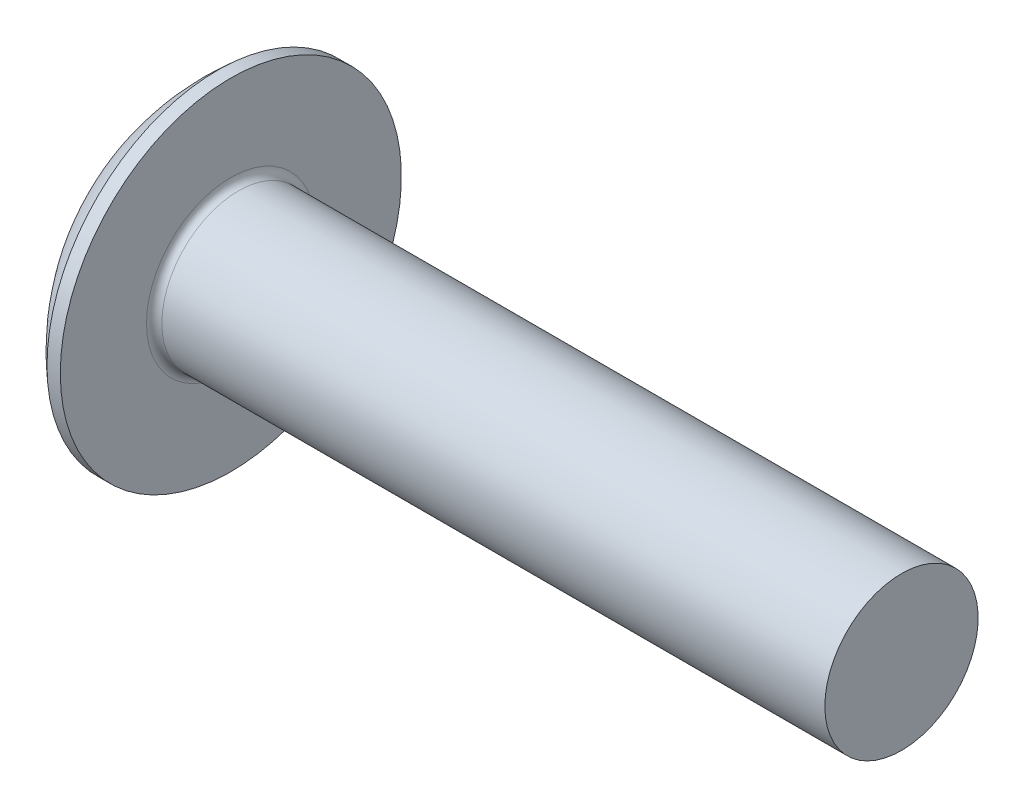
ISO-10303-21;
HEADER;
FILE_DESCRIPTION(('STEP AP214'),'2;1');
FILE_NAME('part.step','',(''),(''),'','','');
FILE_SCHEMA(('AUTOMOTIVE_DESIGN { 1 0 10303 214 1 1 1 1 }'));
ENDSEC;
DATA;
#1=APPLICATION_CONTEXT('core data for automotive mechanical design processes');
#2=APPLICATION_PROTOCOL_DEFINITION('international standard','automotive_design',2000,#1);
#3=PRODUCT_CONTEXT('',#1,'mechanical');
#4=PRODUCT('Part','Part','',(#3));
#5=PRODUCT_RELATED_PRODUCT_CATEGORY('part','',(#4));
#6=PRODUCT_DEFINITION_FORMATION('','',#4);
#7=PRODUCT_DEFINITION_CONTEXT('part definition',#1,'design');
#8=PRODUCT_DEFINITION('design','',#6,#7);
#9=PRODUCT_DEFINITION_SHAPE('','',#8);
#10=(LENGTH_UNIT() NAMED_UNIT(*) SI_UNIT(.MILLI.,.METRE.));
#11=(NAMED_UNIT(*) PLANE_ANGLE_UNIT() SI_UNIT($,.RADIAN.));
#12=(NAMED_UNIT(*) SI_UNIT($,.STERADIAN.) SOLID_ANGLE_UNIT());
#13=UNCERTAINTY_MEASURE_WITH_UNIT(LENGTH_MEASURE(1.E-05),#10,'distance_accuracy_value','');
#14=(GEOMETRIC_REPRESENTATION_CONTEXT(3) GLOBAL_UNCERTAINTY_ASSIGNED_CONTEXT((#13)) GLOBAL_UNIT_ASSIGNED_CONTEXT((#10,
#11,#12)) REPRESENTATION_CONTEXT('',''));
#15=CARTESIAN_POINT('',(0.,0.,0.));
#16=DIRECTION('',(0.,0.,1.));
#17=DIRECTION('',(1.,0.,0.));
#18=AXIS2_PLACEMENT_3D('',#15,#16,#17);
#19=CARTESIAN_POINT('',(11.7,0.,0.));
#20=DIRECTION('',(-1.,0.,0.));
#21=DIRECTION('',(0.,1.,0.));
#22=AXIS2_PLACEMENT_3D('',#19,#20,#21);
#23=SPHERICAL_SURFACE('',#22,11.7);
#24=CARTESIAN_POINT('',(4.10526498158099,0.,0.));
#25=DIRECTION('',(-1.,0.,0.));
#26=DIRECTION('',(0.,0.,1.));
#27=AXIS2_PLACEMENT_3D('',#24,#25,#26);
#28=CIRCLE('',#27,8.9);
#29=CARTESIAN_POINT('',(4.10526498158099,0.,8.9));
#30=VERTEX_POINT('',#29);
#31=EDGE_CURVE('E211',#30,#30,#28,.T.);
#32=ORIENTED_EDGE('',*,*,#31,.T.);
#33=EDGE_LOOP('',(#32));
#34=FACE_BOUND('',#33,.T.);
#35=CARTESIAN_POINT('',(0.106889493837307,0.,0.));
#36=DIRECTION('',(1.,0.,0.));
#37=DIRECTION('',(0.,0.,-1.));
#38=AXIS2_PLACEMENT_3D('',#35,#36,#37);
#39=CIRCLE('',#38,1.57790645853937);
#40=CARTESIAN_POINT('',(0.106889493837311,-0.709999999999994,-1.40914470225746));
#41=VERTEX_POINT('',#40);
#42=CARTESIAN_POINT('',(0.106889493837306,-1.40914470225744,-0.71));
#43=VERTEX_POINT('',#42);
#44=EDGE_CURVE('E334',#41,#43,#39,.F.);
#45=ORIENTED_EDGE('',*,*,#44,.F.);
#46=CARTESIAN_POINT('',(11.7,-0.71,0.));
#47=DIRECTION('',(0.,1.,0.));
#48=DIRECTION('',(0.,0.,1.));
#49=AXIS2_PLACEMENT_3D('',#46,#47,#48);
#50=CIRCLE('',#49,11.6784373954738);
#51=CARTESIAN_POINT('',(0.591869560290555,-0.709999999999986,-3.60490473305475));
#52=VERTEX_POINT('',#51);
#53=EDGE_CURVE('E268',#52,#41,#50,.T.);
#54=ORIENTED_EDGE('',*,*,#53,.F.);
#55=CARTESIAN_POINT('',(10.9279572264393,0.,1.54847829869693));
#56=DIRECTION('',(0.446197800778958,0.,-0.89493436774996));
#57=DIRECTION('',(-0.89493436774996,0.,-0.446197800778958));
#58=AXIS2_PLACEMENT_3D('',#55,#56,#57);
#59=CIRCLE('',#58,11.5713510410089);
#60=CARTESIAN_POINT('',(0.591869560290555,0.710000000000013,-3.60490473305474));
#61=VERTEX_POINT('',#60);
#62=EDGE_CURVE('E242',#52,#61,#59,.T.);
#63=ORIENTED_EDGE('',*,*,#62,.T.);
#64=CARTESIAN_POINT('',(11.7,0.71,0.));
#65=DIRECTION('',(0.,-1.,0.));
#66=DIRECTION('',(0.,0.,-1.));
#67=AXIS2_PLACEMENT_3D('',#64,#65,#66);
#68=CIRCLE('',#67,11.6784373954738);
#69=CARTESIAN_POINT('',(0.106889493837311,0.710000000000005,-1.40914470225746));
#70=VERTEX_POINT('',#69);
#71=EDGE_CURVE('E296',#70,#61,#68,.T.);
#72=ORIENTED_EDGE('',*,*,#71,.F.);
#73=CARTESIAN_POINT('',(0.106889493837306,1.40914470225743,-0.71));
#74=VERTEX_POINT('',#73);
#75=EDGE_CURVE('E349',#74,#70,#39,.F.);
#76=ORIENTED_EDGE('',*,*,#75,.F.);
#77=CARTESIAN_POINT('',(11.7,0.,-0.71));
#78=DIRECTION('',(0.,0.,1.));
#79=DIRECTION('',(0.,-1.,0.));
#80=AXIS2_PLACEMENT_3D('',#77,#78,#79);
#81=CIRCLE('',#80,11.6784373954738);
#82=CARTESIAN_POINT('',(0.591869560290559,3.60490473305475,-0.71));
#83=VERTEX_POINT('',#82);
#84=EDGE_CURVE('E236',#83,#74,#81,.T.);
#85=ORIENTED_EDGE('',*,*,#84,.F.);
#86=CARTESIAN_POINT('',(10.9279572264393,-1.54847829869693,0.));
#87=DIRECTION('',(0.446197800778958,0.89493436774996,0.));
#88=DIRECTION('',(-0.89493436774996,0.446197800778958,0.));
#89=AXIS2_PLACEMENT_3D('',#86,#87,#88);
#90=CIRCLE('',#89,11.5713510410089);
#91=CARTESIAN_POINT('',(0.591869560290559,3.60490473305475,0.71));
#92=VERTEX_POINT('',#91);
#93=EDGE_CURVE('E239',#83,#92,#90,.T.);
#94=ORIENTED_EDGE('',*,*,#93,.T.);
#95=CARTESIAN_POINT('',(11.7,0.,0.71));
#96=DIRECTION('',(0.,0.,-1.));
#97=DIRECTION('',(-1.,0.,0.));
#98=AXIS2_PLACEMENT_3D('',#95,#96,#97);
#99=CIRCLE('',#98,11.6784373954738);
#100=CARTESIAN_POINT('',(0.106889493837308,1.40914470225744,0.709999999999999));
#101=VERTEX_POINT('',#100);
#102=EDGE_CURVE('E232',#101,#92,#99,.T.);
#103=ORIENTED_EDGE('',*,*,#102,.F.);
#104=CARTESIAN_POINT('',(0.106889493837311,0.709999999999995,1.40914470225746));
#105=VERTEX_POINT('',#104);
#106=EDGE_CURVE('E348',#105,#101,#39,.F.);
#107=ORIENTED_EDGE('',*,*,#106,.F.);
#108=CARTESIAN_POINT('',(0.591869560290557,0.709999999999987,3.60490473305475));
#109=VERTEX_POINT('',#108);
#110=EDGE_CURVE('E252',#109,#105,#68,.T.);
#111=ORIENTED_EDGE('',*,*,#110,.F.);
#112=CARTESIAN_POINT('',(10.9279572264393,0.,-1.54847829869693));
#113=DIRECTION('',(0.446197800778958,0.,0.89493436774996));
#114=DIRECTION('',(0.89493436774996,0.,-0.446197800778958));
#115=AXIS2_PLACEMENT_3D('',#112,#113,#114);
#116=CIRCLE('',#115,11.5713510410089);
#117=CARTESIAN_POINT('',(0.591869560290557,-0.710000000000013,3.60490473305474));
#118=VERTEX_POINT('',#117);
#119=EDGE_CURVE('E50',#109,#118,#116,.T.);
#120=ORIENTED_EDGE('',*,*,#119,.T.);
#121=CARTESIAN_POINT('',(0.106889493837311,-0.710000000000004,1.40914470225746));
#122=VERTEX_POINT('',#121);
#123=EDGE_CURVE('E249',#122,#118,#50,.T.);
#124=ORIENTED_EDGE('',*,*,#123,.F.);
#125=CARTESIAN_POINT('',(0.106889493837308,-1.40914470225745,0.709999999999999));
#126=VERTEX_POINT('',#125);
#127=EDGE_CURVE('E380',#126,#122,#39,.F.);
#128=ORIENTED_EDGE('',*,*,#127,.F.);
#129=CARTESIAN_POINT('',(0.591869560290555,-3.60490473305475,0.709999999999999));
#130=VERTEX_POINT('',#129);
#131=EDGE_CURVE('E233',#130,#126,#99,.T.);
#132=ORIENTED_EDGE('',*,*,#131,.F.);
#133=CARTESIAN_POINT('',(10.9279572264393,1.54847829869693,0.));
#134=DIRECTION('',(0.446197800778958,-0.89493436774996,0.));
#135=DIRECTION('',(0.89493436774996,0.446197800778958,0.));
#136=AXIS2_PLACEMENT_3D('',#133,#134,#135);
#137=CIRCLE('',#136,11.5713510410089);
#138=CARTESIAN_POINT('',(0.591869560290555,-3.60490473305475,-0.71));
#139=VERTEX_POINT('',#138);
#140=EDGE_CURVE('E229',#130,#139,#137,.T.);
#141=ORIENTED_EDGE('',*,*,#140,.T.);
#142=EDGE_CURVE('E65',#43,#139,#81,.T.);
#143=ORIENTED_EDGE('',*,*,#142,.F.);
#144=EDGE_LOOP('',(#45,#54,#63,#72,#76,#85,#94,#103,#107,#111,#120,#124,#128,#132,#141,#143));
#145=FACE_BOUND('',#144,.T.);
#146=ADVANCED_FACE('F37',(#34,#145),#23,.T.);
#147=CARTESIAN_POINT('',(4.36,1.72618426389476,-0.71));
#148=DIRECTION('',(0.,0.,1.));
#149=DIRECTION('',(0.,-1.,0.));
#150=AXIS2_PLACEMENT_3D('',#147,#148,#149);
#151=PLANE('',#150);
#152=ORIENTED_EDGE('',*,*,#84,.T.);
#153=CARTESIAN_POINT('',(-2.27573000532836,1.59349745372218,-0.71));
#154=CARTESIAN_POINT('',(-1.79623428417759,1.55678334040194,-0.71));
#155=CARTESIAN_POINT('',(-1.3167533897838,1.51987320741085,-0.71));
#156=CARTESIAN_POINT('',(-0.357821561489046,1.44553064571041,-0.71));
#157=CARTESIAN_POINT('',(0.121629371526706,1.40809820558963,-0.71));
#158=CARTESIAN_POINT('',(0.840767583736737,1.35146130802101,-0.71));
#159=CARTESIAN_POINT('',(1.08047408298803,1.33250095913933,-0.71));
#160=CARTESIAN_POINT('',(1.55987136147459,1.29439407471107,-0.71));
#161=CARTESIAN_POINT('',(1.79956214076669,1.2752475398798,-0.71));
#162=CARTESIAN_POINT('',(2.27892114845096,1.23674247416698,-0.71));
#163=CARTESIAN_POINT('',(2.51858937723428,1.21738394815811,-0.71));
#164=CARTESIAN_POINT('',(2.99790915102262,1.17842161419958,-0.71));
#165=CARTESIAN_POINT('',(3.23756069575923,1.15881780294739,-0.71));
#166=CARTESIAN_POINT('',(3.81787414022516,1.11100121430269,-0.71));
#167=CARTESIAN_POINT('',(4.15852412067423,1.08264345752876,-0.71));
#168=CARTESIAN_POINT('',(4.83976091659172,1.0252056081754,-0.71));
#169=CARTESIAN_POINT('',(5.180347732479,0.996125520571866,-0.71));
#170=CARTESIAN_POINT('',(5.86141585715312,0.937033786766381,-0.71));
#171=CARTESIAN_POINT('',(6.20189717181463,0.907022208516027,-0.71));
#172=CARTESIAN_POINT('',(6.88275726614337,0.845748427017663,-0.71));
#173=CARTESIAN_POINT('',(7.2231360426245,0.814486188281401,-0.71));
#174=CARTESIAN_POINT('',(7.9038331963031,0.750214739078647,-0.71));
#175=CARTESIAN_POINT('',(8.24415152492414,0.717205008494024,-0.71));
#176=CARTESIAN_POINT('',(8.7544164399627,0.665727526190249,-0.71));
#177=CARTESIAN_POINT('',(8.92446199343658,0.648242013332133,-0.71));
#178=CARTESIAN_POINT('',(9.26446866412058,0.612432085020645,-0.71));
#179=CARTESIAN_POINT('',(9.43442977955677,0.594107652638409,-0.71));
#180=CARTESIAN_POINT('',(9.77428973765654,0.556355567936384,-0.71));
#181=CARTESIAN_POINT('',(9.94418853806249,0.536927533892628,-0.71));
#182=CARTESIAN_POINT('',(10.2838014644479,0.496576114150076,-0.71));
#183=CARTESIAN_POINT('',(10.4535156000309,0.47565281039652,-0.71));
#184=CARTESIAN_POINT('',(10.7078990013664,0.44261077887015,-0.71));
#185=CARTESIAN_POINT('',(10.7926753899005,0.431318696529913,-0.71));
#186=CARTESIAN_POINT('',(10.9621296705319,0.408031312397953,-0.71));
#187=CARTESIAN_POINT('',(11.0468075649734,0.396036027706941,-0.71));
#188=CARTESIAN_POINT('',(11.2160489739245,0.371145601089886,-0.71));
#189=CARTESIAN_POINT('',(11.3006124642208,0.358250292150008,-0.71));
#190=CARTESIAN_POINT('',(11.4695410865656,0.331182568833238,-0.71));
#191=CARTESIAN_POINT('',(11.5539062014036,0.317010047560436,-0.71));
#192=CARTESIAN_POINT('',(11.6381309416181,0.302010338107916,-0.71));
#193=B_SPLINE_CURVE_WITH_KNOTS('',3,(#153,#154,#155,#156,#157,#158,#159,#160,#161,#162,#163,
#164,#165,#166,#167,#168,#169,#170,#171,#172,#173,#174,#175,#176,#177,#178,#179,#180,#181,#182,
#183,#184,#185,#186,#187,#188,#189,#190,#191,#192),.UNSPECIFIED.,.F.,.F.,(4,2,2,2,2,2,2,2,2,2,2,
2,2,2,2,2,2,2,2,4),(0.,1.44269795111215,2.88542747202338,3.60679299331,4.32815574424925,
5.04950194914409,5.77085787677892,6.79634208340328,7.8218192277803,8.84722173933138,
9.87265336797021,10.8983919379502,11.4112170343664,11.9240524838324,12.4370664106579,
12.9500522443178,13.2066252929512,13.463192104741,13.7198066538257,13.976442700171),.UNSPECIFIED.);
#194=CARTESIAN_POINT('',(4.36,1.06563607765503,-0.71));
#195=VERTEX_POINT('',#194);
#196=EDGE_CURVE('E369',#74,#195,#193,.T.);
#197=ORIENTED_EDGE('',*,*,#196,.T.);
#198=DIRECTION('',(0.,1.,0.));
#199=VECTOR('',#198,1.);
#200=CARTESIAN_POINT('',(4.36,-1.72618426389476,-0.71));
#201=LINE('',#200,#199);
#202=CARTESIAN_POINT('',(4.36,1.72618426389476,-0.71));
#203=VERTEX_POINT('',#202);
#204=EDGE_CURVE('E317',#195,#203,#201,.T.);
#205=ORIENTED_EDGE('',*,*,#204,.T.);
#206=DIRECTION('',(0.89493436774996,-0.446197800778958,0.));
#207=VECTOR('',#206,1.);
#208=CARTESIAN_POINT('',(0.,3.9,-0.71));
#209=LINE('',#208,#207);
#210=EDGE_CURVE('E212',#83,#203,#209,.T.);
#211=ORIENTED_EDGE('',*,*,#210,.F.);
#212=EDGE_LOOP('',(#152,#197,#205,#211));
#213=FACE_BOUND('',#212,.T.);
#214=ADVANCED_FACE('F171',(#213),#151,.T.);
#215=CARTESIAN_POINT('',(4.36,-1.72618426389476,-0.71));
#216=VERTEX_POINT('',#215);
#217=CARTESIAN_POINT('',(4.36,-1.06563607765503,-0.71));
#218=VERTEX_POINT('',#217);
#219=EDGE_CURVE('E220',#216,#218,#201,.T.);
#220=ORIENTED_EDGE('',*,*,#219,.T.);
#221=CARTESIAN_POINT('',(-2.27573001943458,-1.59349745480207,-0.71));
#222=CARTESIAN_POINT('',(-1.79623429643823,-1.55678334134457,-0.71));
#223=CARTESIAN_POINT('',(-1.31675340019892,-1.5198732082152,-0.71));
#224=CARTESIAN_POINT('',(-0.357821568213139,-1.44553064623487,-0.71));
#225=CARTESIAN_POINT('',(0.121629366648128,-1.40809820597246,-0.71));
#226=CARTESIAN_POINT('',(0.840767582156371,-1.35146130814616,-0.71));
#227=CARTESIAN_POINT('',(1.08047408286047,-1.33250095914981,-0.71));
#228=CARTESIAN_POINT('',(1.55987136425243,-1.29439407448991,-0.71));
#229=CARTESIAN_POINT('',(1.79956214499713,-1.27524753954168,-0.71));
#230=CARTESIAN_POINT('',(2.27892115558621,-1.23674247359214,-0.71));
#231=CARTESIAN_POINT('',(2.51858938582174,-1.21738394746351,-0.71));
#232=CARTESIAN_POINT('',(2.99790916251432,-1.17842161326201,-0.71));
#233=CARTESIAN_POINT('',(3.23756070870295,-1.1588178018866,-0.71));
#234=CARTESIAN_POINT('',(3.81787415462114,-1.11100121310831,-0.71));
#235=CARTESIAN_POINT('',(4.15852413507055,-1.08264345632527,-0.71));
#236=CARTESIAN_POINT('',(4.83976093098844,-1.02520560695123,-0.71));
#237=CARTESIAN_POINT('',(5.18034774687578,-0.996125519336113,-0.71));
#238=CARTESIAN_POINT('',(5.86141587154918,-0.937033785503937,-0.71));
#239=CARTESIAN_POINT('',(6.20189718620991,-0.90702220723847,-0.71));
#240=CARTESIAN_POINT('',(6.88275728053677,-0.845748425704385,-0.71));
#241=CARTESIAN_POINT('',(7.2231360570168,-0.814486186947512,-0.71));
#242=CARTESIAN_POINT('',(7.90383321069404,-0.750214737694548,-0.71));
#243=CARTESIAN_POINT('',(8.24415153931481,-0.717205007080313,-0.71));
#244=CARTESIAN_POINT('',(8.75441645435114,-0.665727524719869,-0.71));
#245=CARTESIAN_POINT('',(8.92446200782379,-0.648242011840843,-0.71));
#246=CARTESIAN_POINT('',(9.2644686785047,-0.612432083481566,-0.71));
#247=CARTESIAN_POINT('',(9.43442979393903,-0.59410765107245,-0.71));
#248=CARTESIAN_POINT('',(9.77428975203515,-0.55635556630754,-0.71));
#249=CARTESIAN_POINT('',(9.94418855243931,-0.53692753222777,-0.71));
#250=CARTESIAN_POINT('',(10.2838014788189,-0.49657611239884,-0.71));
#251=CARTESIAN_POINT('',(10.4535156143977,-0.475652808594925,-0.71));
#252=CARTESIAN_POINT('',(10.7078990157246,-0.442610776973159,-0.71));
#253=CARTESIAN_POINT('',(10.7926754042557,-0.431318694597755,-0.71));
#254=CARTESIAN_POINT('',(10.9621296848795,-0.408031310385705,-0.71));
#255=CARTESIAN_POINT('',(11.0468075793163,-0.396036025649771,-0.71));
#256=CARTESIAN_POINT('',(11.2160489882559,-0.371145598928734,-0.71));
#257=CARTESIAN_POINT('',(11.3006124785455,-0.358250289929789,-0.71));
#258=CARTESIAN_POINT('',(11.469541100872,-0.331182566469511,-0.71));
#259=CARTESIAN_POINT('',(11.5539062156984,-0.317010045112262,-0.71));
#260=CARTESIAN_POINT('',(11.6381309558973,-0.302010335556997,-0.71));
#261=B_SPLINE_CURVE_WITH_KNOTS('',3,(#221,#222,#223,#224,#225,#226,#227,#228,#229,#230,#231,
#232,#233,#234,#235,#236,#237,#238,#239,#240,#241,#242,#243,#244,#245,#246,#247,#248,#249,#250,
#251,#252,#253,#254,#255,#256,#257,#258,#259,#260),.UNSPECIFIED.,.F.,.F.,(4,2,2,2,2,2,2,2,2,2,2,
2,2,2,2,2,2,2,2,4),(0.,1.44269795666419,2.88542748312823,3.60679300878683,4.32815576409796,
5.04950197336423,5.77085790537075,6.7963421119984,7.82181925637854,8.84722176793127,
9.87265339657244,10.8983919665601,11.411217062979,11.9240525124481,12.4370664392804,
12.9500522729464,13.2066253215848,13.4631921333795,13.7198066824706,13.9764427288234),.UNSPECIFIED.);
#262=EDGE_CURVE('E347',#218,#43,#261,.F.);
#263=ORIENTED_EDGE('',*,*,#262,.T.);
#264=ORIENTED_EDGE('',*,*,#142,.T.);
#265=DIRECTION('',(0.89493436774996,0.446197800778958,0.));
#266=VECTOR('',#265,1.);
#267=CARTESIAN_POINT('',(0.,-3.9,-0.71));
#268=LINE('',#267,#266);
#269=EDGE_CURVE('E299',#139,#216,#268,.T.);
#270=ORIENTED_EDGE('',*,*,#269,.T.);
#271=EDGE_LOOP('',(#220,#263,#264,#270));
#272=FACE_BOUND('',#271,.T.);
#273=ADVANCED_FACE('F177',(#272),#151,.T.);
#274=CARTESIAN_POINT('',(4.36,-1.72618426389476,0.71));
#275=DIRECTION('',(0.,0.,-1.));
#276=DIRECTION('',(-1.,0.,0.));
#277=AXIS2_PLACEMENT_3D('',#274,#275,#276);
#278=PLANE('',#277);
#279=DIRECTION('',(0.,-1.,0.));
#280=VECTOR('',#279,1.);
#281=CARTESIAN_POINT('',(4.36,1.72618426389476,0.71));
#282=LINE('',#281,#280);
#283=CARTESIAN_POINT('',(4.36,1.72618426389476,0.71));
#284=VERTEX_POINT('',#283);
#285=CARTESIAN_POINT('',(4.36,1.06563607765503,0.71));
#286=VERTEX_POINT('',#285);
#287=EDGE_CURVE('E307',#284,#286,#282,.T.);
#288=ORIENTED_EDGE('',*,*,#287,.T.);
#289=CARTESIAN_POINT('',(-2.27573000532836,1.59349745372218,0.709999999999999));
#290=CARTESIAN_POINT('',(-1.79623428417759,1.55678334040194,0.709999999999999));
#291=CARTESIAN_POINT('',(-1.3167533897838,1.51987320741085,0.709999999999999));
#292=CARTESIAN_POINT('',(-0.357821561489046,1.44553064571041,0.709999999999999));
#293=CARTESIAN_POINT('',(0.121629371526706,1.40809820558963,0.709999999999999));
#294=CARTESIAN_POINT('',(0.840767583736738,1.35146130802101,0.71));
#295=CARTESIAN_POINT('',(1.08047408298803,1.33250095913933,0.71));
#296=CARTESIAN_POINT('',(1.55987136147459,1.29439407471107,0.71));
#297=CARTESIAN_POINT('',(1.79956214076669,1.2752475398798,0.71));
#298=CARTESIAN_POINT('',(2.27892114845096,1.23674247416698,0.71));
#299=CARTESIAN_POINT('',(2.51858937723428,1.21738394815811,0.71));
#300=CARTESIAN_POINT('',(2.99790915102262,1.17842161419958,0.71));
#301=CARTESIAN_POINT('',(3.23756069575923,1.15881780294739,0.71));
#302=CARTESIAN_POINT('',(3.81787414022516,1.11100121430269,0.71));
#303=CARTESIAN_POINT('',(4.15852412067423,1.08264345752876,0.71));
#304=CARTESIAN_POINT('',(4.83976091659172,1.0252056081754,0.71));
#305=CARTESIAN_POINT('',(5.180347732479,0.996125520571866,0.71));
#306=CARTESIAN_POINT('',(5.86141585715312,0.937033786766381,0.71));
#307=CARTESIAN_POINT('',(6.20189717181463,0.907022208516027,0.71));
#308=CARTESIAN_POINT('',(6.88275726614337,0.845748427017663,0.71));
#309=CARTESIAN_POINT('',(7.2231360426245,0.8144861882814,0.71));
#310=CARTESIAN_POINT('',(7.90383319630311,0.750214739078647,0.71));
#311=CARTESIAN_POINT('',(8.24415152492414,0.717205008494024,0.71));
#312=CARTESIAN_POINT('',(8.7544164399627,0.665727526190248,0.71));
#313=CARTESIAN_POINT('',(8.92446199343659,0.648242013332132,0.71));
#314=CARTESIAN_POINT('',(9.26446866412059,0.612432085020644,0.71));
#315=CARTESIAN_POINT('',(9.43442977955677,0.594107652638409,0.71));
#316=CARTESIAN_POINT('',(9.77428973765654,0.556355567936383,0.71));
#317=CARTESIAN_POINT('',(9.94418853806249,0.536927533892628,0.71));
#318=CARTESIAN_POINT('',(10.2838014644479,0.496576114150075,0.71));
#319=CARTESIAN_POINT('',(10.4535156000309,0.475652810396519,0.71));
#320=CARTESIAN_POINT('',(10.7078990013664,0.442610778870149,0.71));
#321=CARTESIAN_POINT('',(10.7926753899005,0.431318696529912,0.71));
#322=CARTESIAN_POINT('',(10.9621296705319,0.408031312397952,0.71));
#323=CARTESIAN_POINT('',(11.0468075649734,0.39603602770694,0.71));
#324=CARTESIAN_POINT('',(11.2160489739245,0.371145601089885,0.71));
#325=CARTESIAN_POINT('',(11.3006124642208,0.358250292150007,0.71));
#326=CARTESIAN_POINT('',(11.4695410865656,0.331182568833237,0.71));
#327=CARTESIAN_POINT('',(11.5539062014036,0.317010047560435,0.71));
#328=CARTESIAN_POINT('',(11.6381309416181,0.302010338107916,0.710000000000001));
#329=B_SPLINE_CURVE_WITH_KNOTS('',3,(#289,#290,#291,#292,#293,#294,#295,#296,#297,#298,#299,
#300,#301,#302,#303,#304,#305,#306,#307,#308,#309,#310,#311,#312,#313,#314,#315,#316,#317,#318,
#319,#320,#321,#322,#323,#324,#325,#326,#327,#328),.UNSPECIFIED.,.F.,.F.,(4,2,2,2,2,2,2,2,2,2,2,
2,2,2,2,2,2,2,2,4),(0.,1.44269795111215,2.88542747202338,3.60679299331,4.32815574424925,
5.04950194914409,5.77085787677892,6.79634208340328,7.8218192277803,8.84722173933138,
9.87265336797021,10.8983919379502,11.4112170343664,11.9240524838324,12.4370664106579,
12.9500522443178,13.2066252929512,13.463192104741,13.7198066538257,13.976442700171),.UNSPECIFIED.);
#330=EDGE_CURVE('E273',#286,#101,#329,.F.);
#331=ORIENTED_EDGE('',*,*,#330,.T.);
#332=ORIENTED_EDGE('',*,*,#102,.T.);
#333=DIRECTION('',(0.89493436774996,-0.446197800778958,0.));
#334=VECTOR('',#333,1.);
#335=CARTESIAN_POINT('',(0.,3.9,0.71));
#336=LINE('',#335,#334);
#337=EDGE_CURVE('E217',#92,#284,#336,.T.);
#338=ORIENTED_EDGE('',*,*,#337,.T.);
#339=EDGE_LOOP('',(#288,#331,#332,#338));
#340=FACE_BOUND('',#339,.T.);
#341=ADVANCED_FACE('F365',(#340),#278,.T.);
#342=ORIENTED_EDGE('',*,*,#131,.T.);
#343=CARTESIAN_POINT('',(-2.27573001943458,-1.59349745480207,0.709999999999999));
#344=CARTESIAN_POINT('',(-1.79623429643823,-1.55678334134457,0.709999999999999));
#345=CARTESIAN_POINT('',(-1.31675340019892,-1.5198732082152,0.709999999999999));
#346=CARTESIAN_POINT('',(-0.357821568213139,-1.44553064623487,0.709999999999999));
#347=CARTESIAN_POINT('',(0.121629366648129,-1.40809820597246,0.709999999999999));
#348=CARTESIAN_POINT('',(0.840767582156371,-1.35146130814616,0.709999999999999));
#349=CARTESIAN_POINT('',(1.08047408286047,-1.33250095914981,0.709999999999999));
#350=CARTESIAN_POINT('',(1.55987136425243,-1.29439407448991,0.709999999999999));
#351=CARTESIAN_POINT('',(1.79956214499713,-1.27524753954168,0.709999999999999));
#352=CARTESIAN_POINT('',(2.27892115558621,-1.23674247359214,0.709999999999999));
#353=CARTESIAN_POINT('',(2.51858938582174,-1.21738394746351,0.71));
#354=CARTESIAN_POINT('',(2.99790916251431,-1.17842161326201,0.71));
#355=CARTESIAN_POINT('',(3.23756070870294,-1.1588178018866,0.71));
#356=CARTESIAN_POINT('',(3.81787415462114,-1.11100121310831,0.71));
#357=CARTESIAN_POINT('',(4.15852413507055,-1.08264345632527,0.71));
#358=CARTESIAN_POINT('',(4.83976093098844,-1.02520560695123,0.71));
#359=CARTESIAN_POINT('',(5.18034774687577,-0.996125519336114,0.71));
#360=CARTESIAN_POINT('',(5.86141587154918,-0.937033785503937,0.71));
#361=CARTESIAN_POINT('',(6.20189718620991,-0.90702220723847,0.71));
#362=CARTESIAN_POINT('',(6.88275728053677,-0.845748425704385,0.71));
#363=CARTESIAN_POINT('',(7.2231360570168,-0.814486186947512,0.71));
#364=CARTESIAN_POINT('',(7.90383321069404,-0.750214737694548,0.71));
#365=CARTESIAN_POINT('',(8.24415153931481,-0.717205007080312,0.71));
#366=CARTESIAN_POINT('',(8.75441645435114,-0.665727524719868,0.71));
#367=CARTESIAN_POINT('',(8.92446200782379,-0.648242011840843,0.71));
#368=CARTESIAN_POINT('',(9.2644686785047,-0.612432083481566,0.71));
#369=CARTESIAN_POINT('',(9.43442979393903,-0.59410765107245,0.71));
#370=CARTESIAN_POINT('',(9.77428975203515,-0.55635556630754,0.71));
#371=CARTESIAN_POINT('',(9.94418855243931,-0.53692753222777,0.71));
#372=CARTESIAN_POINT('',(10.2838014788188,-0.49657611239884,0.71));
#373=CARTESIAN_POINT('',(10.4535156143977,-0.475652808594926,0.71));
#374=CARTESIAN_POINT('',(10.7078990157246,-0.442610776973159,0.71));
#375=CARTESIAN_POINT('',(10.7926754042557,-0.431318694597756,0.71));
#376=CARTESIAN_POINT('',(10.9621296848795,-0.408031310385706,0.71));
#377=CARTESIAN_POINT('',(11.0468075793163,-0.396036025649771,0.71));
#378=CARTESIAN_POINT('',(11.2160489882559,-0.371145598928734,0.71));
#379=CARTESIAN_POINT('',(11.3006124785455,-0.35825028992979,0.71));
#380=CARTESIAN_POINT('',(11.469541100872,-0.331182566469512,0.71));
#381=CARTESIAN_POINT('',(11.5539062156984,-0.317010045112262,0.71));
#382=CARTESIAN_POINT('',(11.6381309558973,-0.302010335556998,0.71));
#383=B_SPLINE_CURVE_WITH_KNOTS('',3,(#343,#344,#345,#346,#347,#348,#349,#350,#351,#352,#353,
#354,#355,#356,#357,#358,#359,#360,#361,#362,#363,#364,#365,#366,#367,#368,#369,#370,#371,#372,
#373,#374,#375,#376,#377,#378,#379,#380,#381,#382),.UNSPECIFIED.,.F.,.F.,(4,2,2,2,2,2,2,2,2,2,2,
2,2,2,2,2,2,2,2,4),(0.,1.44269795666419,2.88542748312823,3.60679300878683,4.32815576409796,
5.04950197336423,5.77085790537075,6.7963421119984,7.82181925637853,8.84722176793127,
9.87265339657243,10.8983919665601,11.411217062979,11.9240525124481,12.4370664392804,
12.9500522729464,13.2066253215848,13.4631921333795,13.7198066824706,13.9764427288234),.UNSPECIFIED.);
#384=CARTESIAN_POINT('',(4.36,-1.06563607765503,0.709999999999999));
#385=VERTEX_POINT('',#384);
#386=EDGE_CURVE('E381',#126,#385,#383,.T.);
#387=ORIENTED_EDGE('',*,*,#386,.T.);
#388=CARTESIAN_POINT('',(4.36,-1.72618426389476,0.71));
#389=VERTEX_POINT('',#388);
#390=EDGE_CURVE('E309',#385,#389,#282,.T.);
#391=ORIENTED_EDGE('',*,*,#390,.T.);
#392=DIRECTION('',(0.89493436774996,0.446197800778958,0.));
#393=VECTOR('',#392,1.);
#394=CARTESIAN_POINT('',(0.,-3.9,0.709999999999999));
#395=LINE('',#394,#393);
#396=EDGE_CURVE('E301',#130,#389,#395,.T.);
#397=ORIENTED_EDGE('',*,*,#396,.F.);
#398=EDGE_LOOP('',(#342,#387,#391,#397));
#399=FACE_BOUND('',#398,.T.);
#400=ADVANCED_FACE('F408',(#399),#278,.T.);
#401=CARTESIAN_POINT('',(4.36,1.72618426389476,-0.71));
#402=DIRECTION('',(-1.,0.,0.));
#403=DIRECTION('',(0.,0.,1.));
#404=AXIS2_PLACEMENT_3D('',#401,#402,#403);
#405=PLANE('',#404);
#406=ORIENTED_EDGE('',*,*,#390,.F.);
#407=CARTESIAN_POINT('',(4.36,0.,0.));
#408=DIRECTION('',(-1.,0.,0.));
#409=DIRECTION('',(0.,0.,1.));
#410=AXIS2_PLACEMENT_3D('',#407,#408,#409);
#411=CIRCLE('',#410,1.2805);
#412=EDGE_CURVE('E342',#218,#385,#411,.T.);
#413=ORIENTED_EDGE('',*,*,#412,.F.);
#414=ORIENTED_EDGE('',*,*,#219,.F.);
#415=DIRECTION('',(0.,0.,1.));
#416=VECTOR('',#415,1.);
#417=CARTESIAN_POINT('',(4.36,-1.72618426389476,-0.71));
#418=LINE('',#417,#416);
#419=EDGE_CURVE('E304',#216,#389,#418,.T.);
#420=ORIENTED_EDGE('',*,*,#419,.T.);
#421=EDGE_LOOP('',(#406,#413,#414,#420));
#422=FACE_BOUND('',#421,.T.);
#423=ADVANCED_FACE('F406',(#422),#405,.T.);
#424=DIRECTION('',(0.,0.,-1.));
#425=VECTOR('',#424,1.);
#426=CARTESIAN_POINT('',(4.36,-0.710000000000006,1.72618426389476));
#427=LINE('',#426,#425);
#428=CARTESIAN_POINT('',(4.36,-0.709999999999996,-1.06563607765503));
#429=VERTEX_POINT('',#428);
#430=CARTESIAN_POINT('',(4.36,-0.709999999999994,-1.72618426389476));
#431=VERTEX_POINT('',#430);
#432=EDGE_CURVE('E290',#429,#431,#427,.T.);
#433=ORIENTED_EDGE('',*,*,#432,.F.);
#434=CARTESIAN_POINT('',(4.36,0.710000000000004,-1.06563607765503));
#435=VERTEX_POINT('',#434);
#436=EDGE_CURVE('E57',#435,#429,#411,.T.);
#437=ORIENTED_EDGE('',*,*,#436,.F.);
#438=DIRECTION('',(0.,0.,1.));
#439=VECTOR('',#438,1.);
#440=CARTESIAN_POINT('',(4.36,0.710000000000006,-1.72618426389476));
#441=LINE('',#440,#439);
#442=CARTESIAN_POINT('',(4.36,0.710000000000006,-1.72618426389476));
#443=VERTEX_POINT('',#442);
#444=EDGE_CURVE('E293',#443,#435,#441,.T.);
#445=ORIENTED_EDGE('',*,*,#444,.F.);
#446=DIRECTION('',(0.,-1.,0.));
#447=VECTOR('',#446,1.);
#448=CARTESIAN_POINT('',(4.36,0.710000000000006,-1.72618426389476));
#449=LINE('',#448,#447);
#450=EDGE_CURVE('E284',#443,#431,#449,.T.);
#451=ORIENTED_EDGE('',*,*,#450,.T.);
#452=EDGE_LOOP('',(#433,#437,#445,#451));
#453=FACE_BOUND('',#452,.T.);
#454=ADVANCED_FACE('F337',(#453),#405,.T.);
#455=ORIENTED_EDGE('',*,*,#204,.F.);
#456=EDGE_CURVE('E341',#286,#195,#411,.T.);
#457=ORIENTED_EDGE('',*,*,#456,.F.);
#458=ORIENTED_EDGE('',*,*,#287,.F.);
#459=DIRECTION('',(0.,0.,-1.));
#460=VECTOR('',#459,1.);
#461=CARTESIAN_POINT('',(4.36,1.72618426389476,0.71));
#462=LINE('',#461,#460);
#463=EDGE_CURVE('E310',#284,#203,#462,.T.);
#464=ORIENTED_EDGE('',*,*,#463,.T.);
#465=EDGE_LOOP('',(#455,#457,#458,#464));
#466=FACE_BOUND('',#465,.T.);
#467=ADVANCED_FACE('F415',(#466),#405,.T.);
#468=CARTESIAN_POINT('',(4.36,0.709999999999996,1.06563607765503));
#469=VERTEX_POINT('',#468);
#470=CARTESIAN_POINT('',(4.36,0.709999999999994,1.72618426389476));
#471=VERTEX_POINT('',#470);
#472=EDGE_CURVE('E266',#469,#471,#441,.T.);
#473=ORIENTED_EDGE('',*,*,#472,.F.);
#474=CARTESIAN_POINT('',(4.36,-0.710000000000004,1.06563607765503));
#475=VERTEX_POINT('',#474);
#476=EDGE_CURVE('E345',#475,#469,#411,.T.);
#477=ORIENTED_EDGE('',*,*,#476,.F.);
#478=CARTESIAN_POINT('',(4.36,-0.710000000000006,1.72618426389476));
#479=VERTEX_POINT('',#478);
#480=EDGE_CURVE('E287',#479,#475,#427,.T.);
#481=ORIENTED_EDGE('',*,*,#480,.F.);
#482=DIRECTION('',(0.,1.,0.));
#483=VECTOR('',#482,1.);
#484=CARTESIAN_POINT('',(4.36,-0.710000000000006,1.72618426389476));
#485=LINE('',#484,#483);
#486=EDGE_CURVE('E291',#479,#471,#485,.T.);
#487=ORIENTED_EDGE('',*,*,#486,.T.);
#488=EDGE_LOOP('',(#473,#477,#481,#487));
#489=FACE_BOUND('',#488,.T.);
#490=ADVANCED_FACE('F410',(#489),#405,.T.);
#491=CARTESIAN_POINT('',(4.36,0.709999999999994,1.72618426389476));
#492=DIRECTION('',(0.,-1.,0.));
#493=DIRECTION('',(0.,0.,-1.));
#494=AXIS2_PLACEMENT_3D('',#491,#492,#493);
#495=PLANE('',#494);
#496=ORIENTED_EDGE('',*,*,#110,.T.);
#497=CARTESIAN_POINT('',(-2.27573001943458,0.709999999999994,1.59349745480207));
#498=CARTESIAN_POINT('',(-1.79623429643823,0.709999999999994,1.55678334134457));
#499=CARTESIAN_POINT('',(-1.31675340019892,0.709999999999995,1.51987320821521));
#500=CARTESIAN_POINT('',(-0.357821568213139,0.709999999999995,1.44553064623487));
#501=CARTESIAN_POINT('',(0.121629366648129,0.709999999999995,1.40809820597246));
#502=CARTESIAN_POINT('',(0.840767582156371,0.709999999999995,1.35146130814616));
#503=CARTESIAN_POINT('',(1.08047408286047,0.709999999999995,1.33250095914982));
#504=CARTESIAN_POINT('',(1.55987136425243,0.709999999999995,1.29439407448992));
#505=CARTESIAN_POINT('',(1.79956214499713,0.709999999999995,1.27524753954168));
#506=CARTESIAN_POINT('',(2.27892115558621,0.709999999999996,1.23674247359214));
#507=CARTESIAN_POINT('',(2.51858938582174,0.709999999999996,1.21738394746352));
#508=CARTESIAN_POINT('',(2.99790916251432,0.709999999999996,1.17842161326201));
#509=CARTESIAN_POINT('',(3.23756070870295,0.709999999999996,1.1588178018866));
#510=CARTESIAN_POINT('',(3.81787415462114,0.709999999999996,1.11100121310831));
#511=CARTESIAN_POINT('',(4.15852413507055,0.709999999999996,1.08264345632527));
#512=CARTESIAN_POINT('',(4.83976093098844,0.709999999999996,1.02520560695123));
#513=CARTESIAN_POINT('',(5.18034774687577,0.709999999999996,0.996125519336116));
#514=CARTESIAN_POINT('',(5.86141587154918,0.709999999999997,0.937033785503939));
#515=CARTESIAN_POINT('',(6.20189718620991,0.709999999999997,0.907022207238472));
#516=CARTESIAN_POINT('',(6.88275728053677,0.709999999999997,0.845748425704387));
#517=CARTESIAN_POINT('',(7.2231360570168,0.709999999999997,0.814486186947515));
#518=CARTESIAN_POINT('',(7.90383321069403,0.709999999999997,0.750214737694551));
#519=CARTESIAN_POINT('',(8.2441515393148,0.709999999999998,0.717205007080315));
#520=CARTESIAN_POINT('',(8.75441645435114,0.709999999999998,0.665727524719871));
#521=CARTESIAN_POINT('',(8.92446200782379,0.709999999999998,0.648242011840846));
#522=CARTESIAN_POINT('',(9.2644686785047,0.709999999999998,0.612432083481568));
#523=CARTESIAN_POINT('',(9.43442979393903,0.709999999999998,0.594107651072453));
#524=CARTESIAN_POINT('',(9.77428975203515,0.709999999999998,0.556355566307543));
#525=CARTESIAN_POINT('',(9.94418855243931,0.709999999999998,0.536927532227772));
#526=CARTESIAN_POINT('',(10.2838014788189,0.709999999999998,0.496576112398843));
#527=CARTESIAN_POINT('',(10.4535156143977,0.709999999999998,0.475652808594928));
#528=CARTESIAN_POINT('',(10.7078990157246,0.709999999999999,0.442610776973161));
#529=CARTESIAN_POINT('',(10.7926754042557,0.709999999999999,0.431318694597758));
#530=CARTESIAN_POINT('',(10.9621296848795,0.709999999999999,0.408031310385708));
#531=CARTESIAN_POINT('',(11.0468075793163,0.709999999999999,0.396036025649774));
#532=CARTESIAN_POINT('',(11.2160489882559,0.709999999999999,0.371145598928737));
#533=CARTESIAN_POINT('',(11.3006124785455,0.709999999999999,0.358250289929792));
#534=CARTESIAN_POINT('',(11.469541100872,0.709999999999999,0.331182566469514));
#535=CARTESIAN_POINT('',(11.5539062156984,0.709999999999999,0.317010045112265));
#536=CARTESIAN_POINT('',(11.6381309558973,0.709999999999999,0.302010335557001));
#537=B_SPLINE_CURVE_WITH_KNOTS('',3,(#497,#498,#499,#500,#501,#502,#503,#504,#505,#506,#507,
#508,#509,#510,#511,#512,#513,#514,#515,#516,#517,#518,#519,#520,#521,#522,#523,#524,#525,#526,
#527,#528,#529,#530,#531,#532,#533,#534,#535,#536),.UNSPECIFIED.,.F.,.F.,(4,2,2,2,2,2,2,2,2,2,2,
2,2,2,2,2,2,2,2,4),(0.,1.44269795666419,2.88542748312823,3.60679300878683,4.32815576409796,
5.04950197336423,5.77085790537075,6.7963421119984,7.82181925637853,8.84722176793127,
9.87265339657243,10.8983919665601,11.411217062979,11.9240525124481,12.4370664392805,
12.9500522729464,13.2066253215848,13.4631921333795,13.7198066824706,13.9764427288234),.UNSPECIFIED.);
#538=EDGE_CURVE('E429',#105,#469,#537,.T.);
#539=ORIENTED_EDGE('',*,*,#538,.T.);
#540=ORIENTED_EDGE('',*,*,#472,.T.);
#541=DIRECTION('',(0.89493436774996,0.,-0.446197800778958));
#542=VECTOR('',#541,1.);
#543=CARTESIAN_POINT('',(0.,0.709999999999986,3.9));
#544=LINE('',#543,#542);
#545=EDGE_CURVE('E259',#109,#471,#544,.T.);
#546=ORIENTED_EDGE('',*,*,#545,.F.);
#547=EDGE_LOOP('',(#496,#539,#540,#546));
#548=FACE_BOUND('',#547,.T.);
#549=ADVANCED_FACE('F263',(#548),#495,.T.);
#550=CARTESIAN_POINT('',(4.36,-0.709999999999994,-1.72618426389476));
#551=DIRECTION('',(0.,1.,0.));
#552=DIRECTION('',(-1.,0.,0.));
#553=AXIS2_PLACEMENT_3D('',#550,#551,#552);
#554=PLANE('',#553);
#555=ORIENTED_EDGE('',*,*,#480,.T.);
#556=CARTESIAN_POINT('',(-2.27573001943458,-0.710000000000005,1.59349745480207));
#557=CARTESIAN_POINT('',(-1.79623429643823,-0.710000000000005,1.55678334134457));
#558=CARTESIAN_POINT('',(-1.31675340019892,-0.710000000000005,1.5198732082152));
#559=CARTESIAN_POINT('',(-0.35782156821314,-0.710000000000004,1.44553064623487));
#560=CARTESIAN_POINT('',(0.121629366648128,-0.710000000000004,1.40809820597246));
#561=CARTESIAN_POINT('',(0.840767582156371,-0.710000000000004,1.35146130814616));
#562=CARTESIAN_POINT('',(1.08047408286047,-0.710000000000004,1.33250095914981));
#563=CARTESIAN_POINT('',(1.55987136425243,-0.710000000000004,1.29439407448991));
#564=CARTESIAN_POINT('',(1.79956214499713,-0.710000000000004,1.27524753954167));
#565=CARTESIAN_POINT('',(2.27892115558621,-0.710000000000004,1.23674247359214));
#566=CARTESIAN_POINT('',(2.51858938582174,-0.710000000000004,1.21738394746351));
#567=CARTESIAN_POINT('',(2.99790916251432,-0.710000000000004,1.17842161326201));
#568=CARTESIAN_POINT('',(3.23756070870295,-0.710000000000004,1.1588178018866));
#569=CARTESIAN_POINT('',(3.81787415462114,-0.710000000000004,1.1110012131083));
#570=CARTESIAN_POINT('',(4.15852413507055,-0.710000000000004,1.08264345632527));
#571=CARTESIAN_POINT('',(4.83976093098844,-0.710000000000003,1.02520560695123));
#572=CARTESIAN_POINT('',(5.18034774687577,-0.710000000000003,0.996125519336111));
#573=CARTESIAN_POINT('',(5.86141587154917,-0.710000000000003,0.937033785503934));
#574=CARTESIAN_POINT('',(6.20189718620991,-0.710000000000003,0.907022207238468));
#575=CARTESIAN_POINT('',(6.88275728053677,-0.710000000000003,0.845748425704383));
#576=CARTESIAN_POINT('',(7.2231360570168,-0.710000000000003,0.81448618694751));
#577=CARTESIAN_POINT('',(7.90383321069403,-0.710000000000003,0.750214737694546));
#578=CARTESIAN_POINT('',(8.2441515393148,-0.710000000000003,0.717205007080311));
#579=CARTESIAN_POINT('',(8.75441645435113,-0.710000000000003,0.665727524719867));
#580=CARTESIAN_POINT('',(8.92446200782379,-0.710000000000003,0.648242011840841));
#581=CARTESIAN_POINT('',(9.2644686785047,-0.710000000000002,0.612432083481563));
#582=CARTESIAN_POINT('',(9.43442979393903,-0.710000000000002,0.594107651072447));
#583=CARTESIAN_POINT('',(9.77428975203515,-0.710000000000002,0.556355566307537));
#584=CARTESIAN_POINT('',(9.94418855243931,-0.710000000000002,0.536927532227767));
#585=CARTESIAN_POINT('',(10.2838014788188,-0.710000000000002,0.496576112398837));
#586=CARTESIAN_POINT('',(10.4535156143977,-0.710000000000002,0.475652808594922));
#587=CARTESIAN_POINT('',(10.7078990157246,-0.710000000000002,0.442610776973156));
#588=CARTESIAN_POINT('',(10.7926754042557,-0.710000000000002,0.431318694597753));
#589=CARTESIAN_POINT('',(10.9621296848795,-0.710000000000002,0.408031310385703));
#590=CARTESIAN_POINT('',(11.0468075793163,-0.710000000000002,0.396036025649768));
#591=CARTESIAN_POINT('',(11.2160489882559,-0.710000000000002,0.371145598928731));
#592=CARTESIAN_POINT('',(11.3006124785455,-0.710000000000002,0.358250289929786));
#593=CARTESIAN_POINT('',(11.469541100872,-0.710000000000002,0.331182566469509));
#594=CARTESIAN_POINT('',(11.5539062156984,-0.710000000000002,0.317010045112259));
#595=CARTESIAN_POINT('',(11.6381309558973,-0.710000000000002,0.302010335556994));
#596=B_SPLINE_CURVE_WITH_KNOTS('',3,(#556,#557,#558,#559,#560,#561,#562,#563,#564,#565,#566,
#567,#568,#569,#570,#571,#572,#573,#574,#575,#576,#577,#578,#579,#580,#581,#582,#583,#584,#585,
#586,#587,#588,#589,#590,#591,#592,#593,#594,#595),.UNSPECIFIED.,.F.,.F.,(4,2,2,2,2,2,2,2,2,2,2,
2,2,2,2,2,2,2,2,4),(0.,1.44269795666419,2.88542748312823,3.60679300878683,4.32815576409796,
5.04950197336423,5.77085790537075,6.7963421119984,7.82181925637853,8.84722176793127,
9.87265339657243,10.8983919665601,11.411217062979,11.9240525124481,12.4370664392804,
12.9500522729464,13.2066253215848,13.4631921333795,13.7198066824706,13.9764427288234),.UNSPECIFIED.);
#597=EDGE_CURVE('E374',#475,#122,#596,.F.);
#598=ORIENTED_EDGE('',*,*,#597,.T.);
#599=ORIENTED_EDGE('',*,*,#123,.T.);
#600=DIRECTION('',(0.89493436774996,0.,-0.446197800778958));
#601=VECTOR('',#600,1.);
#602=CARTESIAN_POINT('',(0.,-0.710000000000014,3.9));
#603=LINE('',#602,#601);
#604=EDGE_CURVE('E261',#118,#479,#603,.T.);
#605=ORIENTED_EDGE('',*,*,#604,.T.);
#606=EDGE_LOOP('',(#555,#598,#599,#605));
#607=FACE_BOUND('',#606,.T.);
#608=ADVANCED_FACE('F202',(#607),#554,.T.);
#609=ORIENTED_EDGE('',*,*,#444,.T.);
#610=CARTESIAN_POINT('',(-2.27573000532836,0.710000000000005,-1.59349745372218));
#611=CARTESIAN_POINT('',(-1.79623428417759,0.710000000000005,-1.55678334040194));
#612=CARTESIAN_POINT('',(-1.3167533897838,0.710000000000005,-1.51987320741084));
#613=CARTESIAN_POINT('',(-0.357821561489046,0.710000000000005,-1.44553064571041));
#614=CARTESIAN_POINT('',(0.121629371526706,0.710000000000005,-1.40809820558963));
#615=CARTESIAN_POINT('',(0.840767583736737,0.710000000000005,-1.351461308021));
#616=CARTESIAN_POINT('',(1.08047408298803,0.710000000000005,-1.33250095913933));
#617=CARTESIAN_POINT('',(1.55987136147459,0.710000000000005,-1.29439407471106));
#618=CARTESIAN_POINT('',(1.79956214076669,0.710000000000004,-1.27524753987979));
#619=CARTESIAN_POINT('',(2.27892114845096,0.710000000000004,-1.23674247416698));
#620=CARTESIAN_POINT('',(2.51858937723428,0.710000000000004,-1.21738394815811));
#621=CARTESIAN_POINT('',(2.99790915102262,0.710000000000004,-1.17842161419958));
#622=CARTESIAN_POINT('',(3.23756069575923,0.710000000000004,-1.15881780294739));
#623=CARTESIAN_POINT('',(3.81787414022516,0.710000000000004,-1.11100121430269));
#624=CARTESIAN_POINT('',(4.15852412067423,0.710000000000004,-1.08264345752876));
#625=CARTESIAN_POINT('',(4.83976091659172,0.710000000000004,-1.0252056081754));
#626=CARTESIAN_POINT('',(5.180347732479,0.710000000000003,-0.996125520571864));
#627=CARTESIAN_POINT('',(5.86141585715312,0.710000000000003,-0.937033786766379));
#628=CARTESIAN_POINT('',(6.20189717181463,0.710000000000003,-0.907022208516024));
#629=CARTESIAN_POINT('',(6.88275726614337,0.710000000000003,-0.845748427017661));
#630=CARTESIAN_POINT('',(7.2231360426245,0.710000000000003,-0.814486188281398));
#631=CARTESIAN_POINT('',(7.9038331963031,0.710000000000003,-0.750214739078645));
#632=CARTESIAN_POINT('',(8.24415152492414,0.710000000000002,-0.717205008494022));
#633=CARTESIAN_POINT('',(8.7544164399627,0.710000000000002,-0.665727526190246));
#634=CARTESIAN_POINT('',(8.92446199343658,0.710000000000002,-0.64824201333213));
#635=CARTESIAN_POINT('',(9.26446866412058,0.710000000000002,-0.612432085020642));
#636=CARTESIAN_POINT('',(9.43442977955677,0.710000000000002,-0.594107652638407));
#637=CARTESIAN_POINT('',(9.77428973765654,0.710000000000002,-0.556355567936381));
#638=CARTESIAN_POINT('',(9.94418853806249,0.710000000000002,-0.536927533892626));
#639=CARTESIAN_POINT('',(10.2838014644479,0.710000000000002,-0.496576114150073));
#640=CARTESIAN_POINT('',(10.4535156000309,0.710000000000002,-0.475652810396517));
#641=CARTESIAN_POINT('',(10.7078990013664,0.710000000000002,-0.442610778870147));
#642=CARTESIAN_POINT('',(10.7926753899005,0.710000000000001,-0.431318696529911));
#643=CARTESIAN_POINT('',(10.9621296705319,0.710000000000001,-0.408031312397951));
#644=CARTESIAN_POINT('',(11.0468075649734,0.710000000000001,-0.396036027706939));
#645=CARTESIAN_POINT('',(11.2160489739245,0.710000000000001,-0.371145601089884));
#646=CARTESIAN_POINT('',(11.3006124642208,0.710000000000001,-0.358250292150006));
#647=CARTESIAN_POINT('',(11.4695410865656,0.710000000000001,-0.331182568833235));
#648=CARTESIAN_POINT('',(11.5539062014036,0.710000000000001,-0.317010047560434));
#649=CARTESIAN_POINT('',(11.6381309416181,0.710000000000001,-0.302010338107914));
#650=B_SPLINE_CURVE_WITH_KNOTS('',3,(#610,#611,#612,#613,#614,#615,#616,#617,#618,#619,#620,
#621,#622,#623,#624,#625,#626,#627,#628,#629,#630,#631,#632,#633,#634,#635,#636,#637,#638,#639,
#640,#641,#642,#643,#644,#645,#646,#647,#648,#649),.UNSPECIFIED.,.F.,.F.,(4,2,2,2,2,2,2,2,2,2,2,
2,2,2,2,2,2,2,2,4),(0.,1.44269795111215,2.88542747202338,3.60679299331,4.32815574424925,
5.04950194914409,5.77085787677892,6.79634208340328,7.8218192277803,8.84722173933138,
9.87265336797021,10.8983919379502,11.4112170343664,11.9240524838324,12.4370664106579,
12.9500522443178,13.2066252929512,13.463192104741,13.7198066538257,13.976442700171),.UNSPECIFIED.);
#651=EDGE_CURVE('E326',#435,#70,#650,.F.);
#652=ORIENTED_EDGE('',*,*,#651,.T.);
#653=ORIENTED_EDGE('',*,*,#71,.T.);
#654=DIRECTION('',(0.89493436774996,0.,0.446197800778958));
#655=VECTOR('',#654,1.);
#656=CARTESIAN_POINT('',(0.,0.710000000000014,-3.9));
#657=LINE('',#656,#655);
#658=EDGE_CURVE('E270',#61,#443,#657,.T.);
#659=ORIENTED_EDGE('',*,*,#658,.T.);
#660=EDGE_LOOP('',(#609,#652,#653,#659));
#661=FACE_BOUND('',#660,.T.);
#662=ADVANCED_FACE('F200',(#661),#495,.T.);
#663=ORIENTED_EDGE('',*,*,#53,.T.);
#664=CARTESIAN_POINT('',(-2.27573000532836,-0.709999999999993,-1.59349745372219));
#665=CARTESIAN_POINT('',(-1.79623428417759,-0.709999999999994,-1.55678334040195));
#666=CARTESIAN_POINT('',(-1.3167533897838,-0.709999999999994,-1.51987320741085));
#667=CARTESIAN_POINT('',(-0.357821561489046,-0.709999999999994,-1.44553064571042));
#668=CARTESIAN_POINT('',(0.121629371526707,-0.709999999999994,-1.40809820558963));
#669=CARTESIAN_POINT('',(0.840767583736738,-0.709999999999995,-1.35146130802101));
#670=CARTESIAN_POINT('',(1.08047408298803,-0.709999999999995,-1.33250095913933));
#671=CARTESIAN_POINT('',(1.55987136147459,-0.709999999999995,-1.29439407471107));
#672=CARTESIAN_POINT('',(1.79956214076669,-0.709999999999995,-1.2752475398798));
#673=CARTESIAN_POINT('',(2.27892114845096,-0.709999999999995,-1.23674247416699));
#674=CARTESIAN_POINT('',(2.51858937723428,-0.709999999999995,-1.21738394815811));
#675=CARTESIAN_POINT('',(2.99790915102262,-0.709999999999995,-1.17842161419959));
#676=CARTESIAN_POINT('',(3.23756069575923,-0.709999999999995,-1.15881780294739));
#677=CARTESIAN_POINT('',(3.81787414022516,-0.709999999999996,-1.11100121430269));
#678=CARTESIAN_POINT('',(4.15852412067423,-0.709999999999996,-1.08264345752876));
#679=CARTESIAN_POINT('',(4.83976091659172,-0.709999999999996,-1.02520560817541));
#680=CARTESIAN_POINT('',(5.180347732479,-0.709999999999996,-0.996125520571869));
#681=CARTESIAN_POINT('',(5.86141585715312,-0.709999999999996,-0.937033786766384));
#682=CARTESIAN_POINT('',(6.20189717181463,-0.709999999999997,-0.907022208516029));
#683=CARTESIAN_POINT('',(6.88275726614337,-0.709999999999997,-0.845748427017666));
#684=CARTESIAN_POINT('',(7.2231360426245,-0.709999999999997,-0.814486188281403));
#685=CARTESIAN_POINT('',(7.9038331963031,-0.709999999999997,-0.75021473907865));
#686=CARTESIAN_POINT('',(8.24415152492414,-0.709999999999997,-0.717205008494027));
#687=CARTESIAN_POINT('',(8.7544164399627,-0.709999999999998,-0.665727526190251));
#688=CARTESIAN_POINT('',(8.92446199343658,-0.709999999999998,-0.648242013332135));
#689=CARTESIAN_POINT('',(9.26446866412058,-0.709999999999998,-0.612432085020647));
#690=CARTESIAN_POINT('',(9.43442977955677,-0.709999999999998,-0.594107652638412));
#691=CARTESIAN_POINT('',(9.77428973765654,-0.709999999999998,-0.556355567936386));
#692=CARTESIAN_POINT('',(9.94418853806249,-0.709999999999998,-0.53692753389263));
#693=CARTESIAN_POINT('',(10.2838014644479,-0.709999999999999,-0.496576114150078));
#694=CARTESIAN_POINT('',(10.4535156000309,-0.709999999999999,-0.475652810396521));
#695=CARTESIAN_POINT('',(10.7078990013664,-0.709999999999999,-0.442610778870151));
#696=CARTESIAN_POINT('',(10.7926753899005,-0.709999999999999,-0.431318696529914));
#697=CARTESIAN_POINT('',(10.9621296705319,-0.709999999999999,-0.408031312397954));
#698=CARTESIAN_POINT('',(11.0468075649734,-0.709999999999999,-0.396036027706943));
#699=CARTESIAN_POINT('',(11.2160489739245,-0.709999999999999,-0.371145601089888));
#700=CARTESIAN_POINT('',(11.3006124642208,-0.709999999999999,-0.35825029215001));
#701=CARTESIAN_POINT('',(11.4695410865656,-0.709999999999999,-0.33118256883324));
#702=CARTESIAN_POINT('',(11.5539062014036,-0.709999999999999,-0.317010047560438));
#703=CARTESIAN_POINT('',(11.6381309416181,-0.709999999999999,-0.302010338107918));
#704=B_SPLINE_CURVE_WITH_KNOTS('',3,(#664,#665,#666,#667,#668,#669,#670,#671,#672,#673,#674,
#675,#676,#677,#678,#679,#680,#681,#682,#683,#684,#685,#686,#687,#688,#689,#690,#691,#692,#693,
#694,#695,#696,#697,#698,#699,#700,#701,#702,#703),.UNSPECIFIED.,.F.,.F.,(4,2,2,2,2,2,2,2,2,2,2,
2,2,2,2,2,2,2,2,4),(0.,1.44269795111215,2.88542747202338,3.60679299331,4.32815574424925,
5.04950194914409,5.77085787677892,6.79634208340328,7.8218192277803,8.84722173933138,
9.87265336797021,10.8983919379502,11.4112170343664,11.9240524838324,12.4370664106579,
12.9500522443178,13.2066252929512,13.463192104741,13.7198066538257,13.976442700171),.UNSPECIFIED.);
#705=EDGE_CURVE('E11',#41,#429,#704,.T.);
#706=ORIENTED_EDGE('',*,*,#705,.T.);
#707=ORIENTED_EDGE('',*,*,#432,.T.);
#708=DIRECTION('',(0.89493436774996,0.,0.446197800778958));
#709=VECTOR('',#708,1.);
#710=CARTESIAN_POINT('',(0.,-0.709999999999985,-3.9));
#711=LINE('',#710,#709);
#712=EDGE_CURVE('E281',#52,#431,#711,.T.);
#713=ORIENTED_EDGE('',*,*,#712,.F.);
#714=EDGE_LOOP('',(#663,#706,#707,#713));
#715=FACE_BOUND('',#714,.T.);
#716=ADVANCED_FACE('F195',(#715),#554,.T.);
#717=CARTESIAN_POINT('',(-25.4,0.,0.));
#718=DIRECTION('',(-1.,0.,0.));
#719=DIRECTION('',(0.,0.,1.));
#720=AXIS2_PLACEMENT_3D('',#717,#718,#719);
#721=CYLINDRICAL_SURFACE('',#720,4.);
#722=CARTESIAN_POINT('',(5.2,0.,0.));
#723=DIRECTION('',(-1.,0.,0.));
#724=DIRECTION('',(0.,0.,1.));
#725=AXIS2_PLACEMENT_3D('',#722,#723,#724);
#726=CIRCLE('',#725,4.);
#727=CARTESIAN_POINT('',(5.2,0.,4.));
#728=VERTEX_POINT('',#727);
#729=EDGE_CURVE('E206',#728,#728,#726,.F.);
#730=ORIENTED_EDGE('',*,*,#729,.T.);
#731=EDGE_LOOP('',(#730));
#732=FACE_BOUND('',#731,.T.);
#733=CARTESIAN_POINT('',(39.8,0.,0.));
#734=DIRECTION('',(-1.,0.,0.));
#735=DIRECTION('',(0.,0.,1.));
#736=AXIS2_PLACEMENT_3D('',#733,#734,#735);
#737=CIRCLE('',#736,4.);
#738=CARTESIAN_POINT('',(39.8,0.,4.));
#739=VERTEX_POINT('',#738);
#740=EDGE_CURVE('E209',#739,#739,#737,.T.);
#741=ORIENTED_EDGE('',*,*,#740,.T.);
#742=EDGE_LOOP('',(#741));
#743=FACE_BOUND('',#742,.T.);
#744=ADVANCED_FACE('F192',(#732,#743),#721,.T.);
#745=CARTESIAN_POINT('',(4.8,4.,0.));
#746=DIRECTION('',(-1.,0.,0.));
#747=DIRECTION('',(0.,0.,1.));
#748=AXIS2_PLACEMENT_3D('',#745,#746,#747);
#749=PLANE('',#748);
#750=CARTESIAN_POINT('',(4.8,0.,0.));
#751=DIRECTION('',(-1.,0.,0.));
#752=DIRECTION('',(0.,0.,1.));
#753=AXIS2_PLACEMENT_3D('',#750,#751,#752);
#754=CIRCLE('',#753,4.4);
#755=CARTESIAN_POINT('',(4.8,0.,4.4));
#756=VERTEX_POINT('',#755);
#757=EDGE_CURVE('E225',#756,#756,#754,.T.);
#758=ORIENTED_EDGE('',*,*,#757,.T.);
#759=EDGE_LOOP('',(#758));
#760=FACE_BOUND('',#759,.T.);
#761=CARTESIAN_POINT('',(4.8,0.,0.));
#762=DIRECTION('',(-1.,0.,0.));
#763=DIRECTION('',(0.,0.,1.));
#764=AXIS2_PLACEMENT_3D('',#761,#762,#763);
#765=CIRCLE('',#764,8.9);
#766=CARTESIAN_POINT('',(4.8,0.,8.9));
#767=VERTEX_POINT('',#766);
#768=EDGE_CURVE('E214',#767,#767,#765,.T.);
#769=ORIENTED_EDGE('',*,*,#768,.F.);
#770=EDGE_LOOP('',(#769));
#771=FACE_BOUND('',#770,.T.);
#772=ADVANCED_FACE('F189',(#760,#771),#749,.F.);
#773=CARTESIAN_POINT('',(-25.4,0.,0.));
#774=DIRECTION('',(-1.,0.,0.));
#775=DIRECTION('',(0.,0.,1.));
#776=AXIS2_PLACEMENT_3D('',#773,#774,#775);
#777=CYLINDRICAL_SURFACE('',#776,8.9);
#778=ORIENTED_EDGE('',*,*,#31,.F.);
#779=EDGE_LOOP('',(#778));
#780=FACE_BOUND('',#779,.T.);
#781=ORIENTED_EDGE('',*,*,#768,.T.);
#782=EDGE_LOOP('',(#781));
#783=FACE_BOUND('',#782,.T.);
#784=ADVANCED_FACE('F186',(#780,#783),#777,.T.);
#785=CARTESIAN_POINT('',(39.8,4.,0.));
#786=DIRECTION('',(1.,0.,0.));
#787=DIRECTION('',(0.,0.,-1.));
#788=AXIS2_PLACEMENT_3D('',#785,#786,#787);
#789=PLANE('',#788);
#790=ORIENTED_EDGE('',*,*,#740,.F.);
#791=EDGE_LOOP('',(#790));
#792=FACE_BOUND('',#791,.T.);
#793=ADVANCED_FACE('F184',(#792),#789,.T.);
#794=CARTESIAN_POINT('',(5.2,0.,0.));
#795=DIRECTION('',(-1.,0.,0.));
#796=DIRECTION('',(0.,0.,1.));
#797=AXIS2_PLACEMENT_3D('',#794,#795,#796);
#798=TOROIDAL_SURFACE('',#797,4.4,0.4);
#799=ORIENTED_EDGE('',*,*,#729,.F.);
#800=EDGE_LOOP('',(#799));
#801=FACE_BOUND('',#800,.T.);
#802=ORIENTED_EDGE('',*,*,#757,.F.);
#803=EDGE_LOOP('',(#802));
#804=FACE_BOUND('',#803,.T.);
#805=ADVANCED_FACE('F39',(#801,#804),#798,.F.);
#806=CARTESIAN_POINT('',(4.36,1.72618426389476,0.71));
#807=DIRECTION('',(0.446197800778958,0.89493436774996,0.));
#808=DIRECTION('',(-0.89493436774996,0.446197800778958,0.));
#809=AXIS2_PLACEMENT_3D('',#806,#807,#808);
#810=PLANE('',#809);
#811=ORIENTED_EDGE('',*,*,#210,.T.);
#812=ORIENTED_EDGE('',*,*,#463,.F.);
#813=ORIENTED_EDGE('',*,*,#337,.F.);
#814=ORIENTED_EDGE('',*,*,#93,.F.);
#815=EDGE_LOOP('',(#811,#812,#813,#814));
#816=FACE_BOUND('',#815,.T.);
#817=ADVANCED_FACE('F363',(#816),#810,.F.);
#818=CARTESIAN_POINT('',(4.36,-1.72618426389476,-0.71));
#819=DIRECTION('',(0.446197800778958,-0.89493436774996,0.));
#820=DIRECTION('',(0.89493436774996,0.446197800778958,0.));
#821=AXIS2_PLACEMENT_3D('',#818,#819,#820);
#822=PLANE('',#821);
#823=ORIENTED_EDGE('',*,*,#396,.T.);
#824=ORIENTED_EDGE('',*,*,#419,.F.);
#825=ORIENTED_EDGE('',*,*,#269,.F.);
#826=ORIENTED_EDGE('',*,*,#140,.F.);
#827=EDGE_LOOP('',(#823,#824,#825,#826));
#828=FACE_BOUND('',#827,.T.);
#829=ADVANCED_FACE('F397',(#828),#822,.F.);
#830=CARTESIAN_POINT('',(4.36,-0.710000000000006,1.72618426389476));
#831=DIRECTION('',(0.446197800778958,0.,0.89493436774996));
#832=DIRECTION('',(-0.89493436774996,0.,0.446197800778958));
#833=AXIS2_PLACEMENT_3D('',#830,#831,#832);
#834=PLANE('',#833);
#835=ORIENTED_EDGE('',*,*,#545,.T.);
#836=ORIENTED_EDGE('',*,*,#486,.F.);
#837=ORIENTED_EDGE('',*,*,#604,.F.);
#838=ORIENTED_EDGE('',*,*,#119,.F.);
#839=EDGE_LOOP('',(#835,#836,#837,#838));
#840=FACE_BOUND('',#839,.T.);
#841=ADVANCED_FACE('F257',(#840),#834,.F.);
#842=CARTESIAN_POINT('',(4.36,0.710000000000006,-1.72618426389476));
#843=DIRECTION('',(0.446197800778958,0.,-0.89493436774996));
#844=DIRECTION('',(0.89493436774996,0.,0.446197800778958));
#845=AXIS2_PLACEMENT_3D('',#842,#843,#844);
#846=PLANE('',#845);
#847=ORIENTED_EDGE('',*,*,#712,.T.);
#848=ORIENTED_EDGE('',*,*,#450,.F.);
#849=ORIENTED_EDGE('',*,*,#658,.F.);
#850=ORIENTED_EDGE('',*,*,#62,.F.);
#851=EDGE_LOOP('',(#847,#848,#849,#850));
#852=FACE_BOUND('',#851,.T.);
#853=ADVANCED_FACE('F329',(#852),#846,.F.);
#854=CARTESIAN_POINT('',(4.36,0.,0.));
#855=DIRECTION('',(-1.,0.,0.));
#856=DIRECTION('',(0.,0.,1.));
#857=AXIS2_PLACEMENT_3D('',#854,#855,#856);
#858=CONICAL_SURFACE('',#857,1.2805,0.0698131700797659);
#859=EDGE_CURVE('E343',#469,#286,#411,.T.);
#860=ORIENTED_EDGE('',*,*,#859,.F.);
#861=ORIENTED_EDGE('',*,*,#538,.F.);
#862=ORIENTED_EDGE('',*,*,#106,.T.);
#863=ORIENTED_EDGE('',*,*,#330,.F.);
#864=EDGE_LOOP('',(#860,#861,#862,#863));
#865=FACE_BOUND('',#864,.T.);
#866=ADVANCED_FACE('F168',(#865),#858,.F.);
#867=ORIENTED_EDGE('',*,*,#127,.T.);
#868=ORIENTED_EDGE('',*,*,#597,.F.);
#869=EDGE_CURVE('E440',#385,#475,#411,.T.);
#870=ORIENTED_EDGE('',*,*,#869,.F.);
#871=ORIENTED_EDGE('',*,*,#386,.F.);
#872=EDGE_LOOP('',(#867,#868,#870,#871));
#873=FACE_BOUND('',#872,.T.);
#874=ADVANCED_FACE('F395',(#873),#858,.F.);
#875=ORIENTED_EDGE('',*,*,#75,.T.);
#876=ORIENTED_EDGE('',*,*,#651,.F.);
#877=EDGE_CURVE('E338',#195,#435,#411,.T.);
#878=ORIENTED_EDGE('',*,*,#877,.F.);
#879=ORIENTED_EDGE('',*,*,#196,.F.);
#880=EDGE_LOOP('',(#875,#876,#878,#879));
#881=FACE_BOUND('',#880,.T.);
#882=ADVANCED_FACE('F166',(#881),#858,.F.);
#883=EDGE_CURVE('E339',#429,#218,#411,.T.);
#884=ORIENTED_EDGE('',*,*,#883,.F.);
#885=ORIENTED_EDGE('',*,*,#705,.F.);
#886=ORIENTED_EDGE('',*,*,#44,.T.);
#887=ORIENTED_EDGE('',*,*,#262,.F.);
#888=EDGE_LOOP('',(#884,#885,#886,#887));
#889=FACE_BOUND('',#888,.T.);
#890=ADVANCED_FACE('F161',(#889),#858,.F.);
#891=CARTESIAN_POINT('',(4.77605967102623,0.,0.));
#892=DIRECTION('',(-1.,0.,0.));
#893=DIRECTION('',(0.,0.,1.));
#894=AXIS2_PLACEMENT_3D('',#891,#892,#893);
#895=CONICAL_SURFACE('',#894,0.,1.25663706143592);
#896=ORIENTED_EDGE('',*,*,#859,.T.);
#897=ORIENTED_EDGE('',*,*,#456,.T.);
#898=ORIENTED_EDGE('',*,*,#877,.T.);
#899=ORIENTED_EDGE('',*,*,#436,.T.);
#900=ORIENTED_EDGE('',*,*,#883,.T.);
#901=ORIENTED_EDGE('',*,*,#412,.T.);
#902=ORIENTED_EDGE('',*,*,#869,.T.);
#903=ORIENTED_EDGE('',*,*,#476,.T.);
#904=EDGE_LOOP('',(#896,#897,#898,#899,#900,#901,#902,#903));
#905=FACE_BOUND('',#904,.T.);
#906=CARTESIAN_POINT('',(4.77605967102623,0.,0.));
#907=VERTEX_POINT('',#906);
#908=VERTEX_LOOP('',#907);
#909=FACE_BOUND('',#908,.T.);
#910=ADVANCED_FACE('F159',(#905,#909),#895,.F.);
#911=CLOSED_SHELL('',(#146,#214,#273,#341,#400,#423,#454,#467,#490,#549,#608,#662,#716,#744,
#772,#784,#793,#805,#817,#829,#841,#853,#866,#874,#882,#890,#910));
#912=MANIFOLD_SOLID_BREP('B2',#911);
#913=ADVANCED_BREP_SHAPE_REPRESENTATION('',(#18,#912),#14);
#914=SHAPE_DEFINITION_REPRESENTATION(#9,#913);
ENDSEC;
END-ISO-10303-21;
